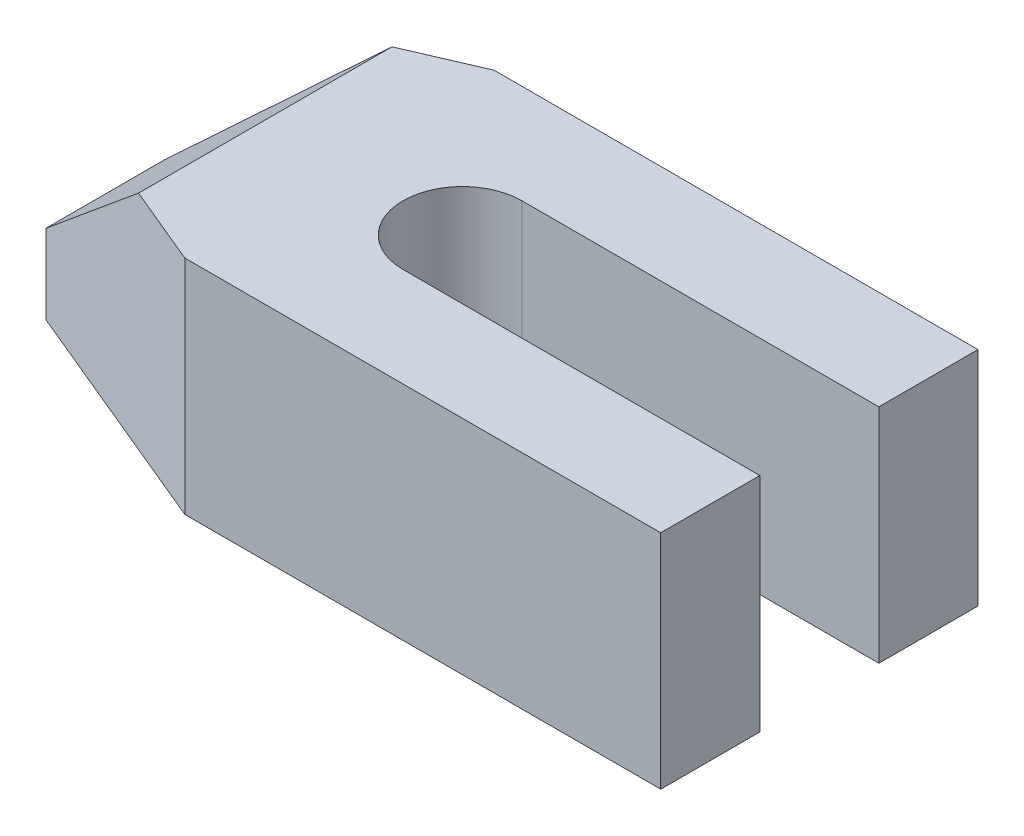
from build123d import *

# Parameters (mm, degrees)
EXTRUSION1_DEPTH        = 28
ENL_V_MAT_EXTRU_1_DEPTH = 83.221234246


with BuildPart() as part:
    # Esquisse1 → Extrusion1 (new body)
    with BuildSketch(Plane(origin=(0, 0, 0), x_dir=(1, 0, 0), z_dir=(0, 1, 0))):
        with BuildLine():
            Line((45, -7.5), (45, -20))
            Line((45, -20), (-15, -20))
            Line((-15, -20), (-45, -7.5))
            Line((-45, -7.5), (-45, 7.5))
            Line((-45, 7.5), (-16, 20))
            Line((-16, 20), (45, 20))
            Line((45, 20), (45, 7.5))
            Line((45, 7.5), (0, 7.5))
            ThreePointArc((0, 7.5), (-7.5, 0), (0, -7.5))
            Line((0, -7.5), (45, -7.5))
        make_face()
    extrude(amount=EXTRUSION1_DEPTH)

    # Esquisse2 → Enl_v. mat.-Extru.1 (cut, through all)
    with BuildSketch(Plane(origin=(-21.153846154, 0, 20), x_dir=(-1, 0, 0), z_dir=(0, 0, -1))):
        Polygon((23.846153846, 10), (3.846153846, 28), (66.922308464, 41.229218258), align=None)
    extrude(amount=ENL_V_MAT_EXTRU_1_DEPTH, mode=Mode.SUBTRACT)


solid = part.part
